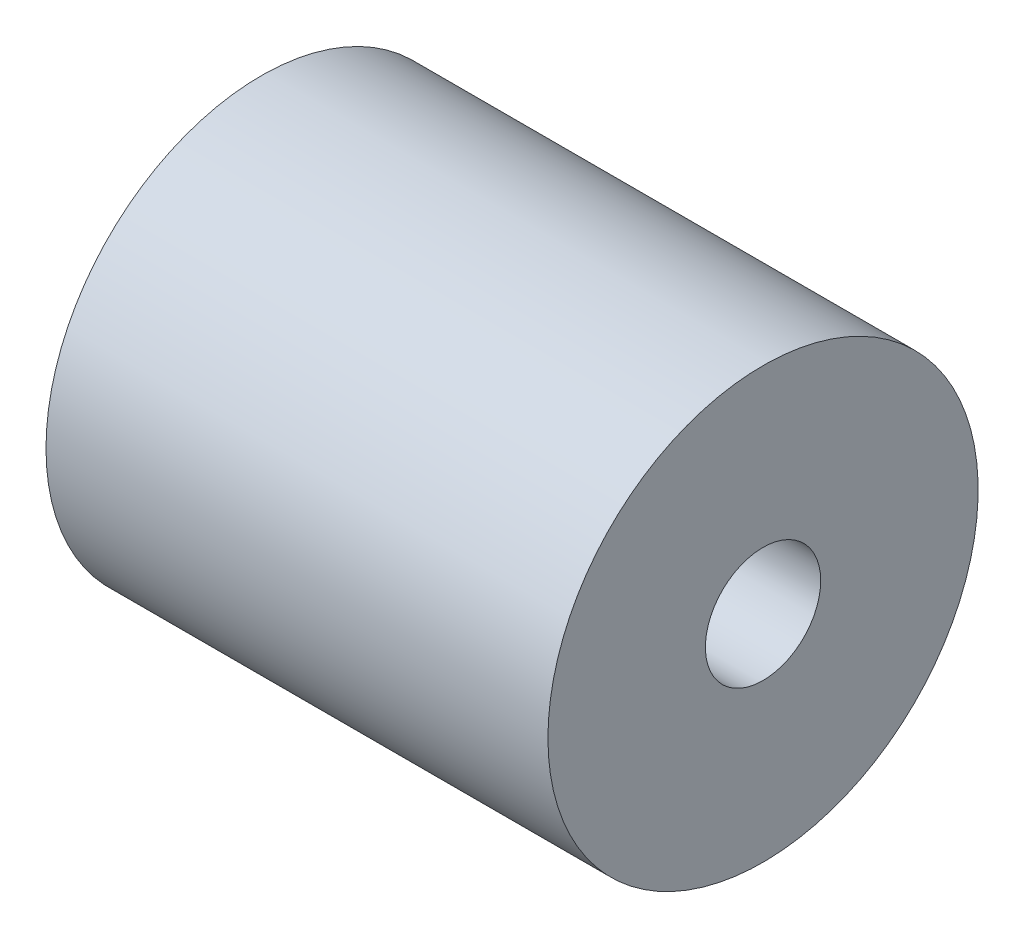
ISO-10303-21;
HEADER;
FILE_DESCRIPTION(('STEP AP214'),'2;1');
FILE_NAME('part.step','',(''),(''),'','','');
FILE_SCHEMA(('AUTOMOTIVE_DESIGN { 1 0 10303 214 1 1 1 1 }'));
ENDSEC;
DATA;
#1=APPLICATION_CONTEXT('core data for automotive mechanical design processes');
#2=APPLICATION_PROTOCOL_DEFINITION('international standard','automotive_design',2000,#1);
#3=PRODUCT_CONTEXT('',#1,'mechanical');
#4=PRODUCT('Part','Part','',(#3));
#5=PRODUCT_RELATED_PRODUCT_CATEGORY('part','',(#4));
#6=PRODUCT_DEFINITION_FORMATION('','',#4);
#7=PRODUCT_DEFINITION_CONTEXT('part definition',#1,'design');
#8=PRODUCT_DEFINITION('design','',#6,#7);
#9=PRODUCT_DEFINITION_SHAPE('','',#8);
#10=(LENGTH_UNIT() NAMED_UNIT(*) SI_UNIT(.MILLI.,.METRE.));
#11=(NAMED_UNIT(*) PLANE_ANGLE_UNIT() SI_UNIT($,.RADIAN.));
#12=(NAMED_UNIT(*) SI_UNIT($,.STERADIAN.) SOLID_ANGLE_UNIT());
#13=UNCERTAINTY_MEASURE_WITH_UNIT(LENGTH_MEASURE(1.E-05),#10,'distance_accuracy_value','');
#14=(GEOMETRIC_REPRESENTATION_CONTEXT(3) GLOBAL_UNCERTAINTY_ASSIGNED_CONTEXT((#13)) GLOBAL_UNIT_ASSIGNED_CONTEXT((#10,
#11,#12)) REPRESENTATION_CONTEXT('',''));
#15=CARTESIAN_POINT('',(0.,0.,0.));
#16=DIRECTION('',(0.,0.,1.));
#17=DIRECTION('',(1.,0.,0.));
#18=AXIS2_PLACEMENT_3D('',#15,#16,#17);
#19=CARTESIAN_POINT('',(9.52499999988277,0.,0.));
#20=DIRECTION('',(1.,0.,0.));
#21=DIRECTION('',(0.,0.,-1.));
#22=AXIS2_PLACEMENT_3D('',#19,#20,#21);
#23=CONICAL_SURFACE('',#22,2.55269999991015,1.02974425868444);
#24=CARTESIAN_POINT('',(7.99118309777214,0.,0.));
#25=VERTEX_POINT('',#24);
#26=VERTEX_LOOP('',#25);
#27=FACE_BOUND('',#26,.T.);
#28=CARTESIAN_POINT('',(9.525,0.,0.));
#29=DIRECTION('',(1.,0.,0.));
#30=DIRECTION('',(0.,0.,-1.));
#31=AXIS2_PLACEMENT_3D('',#28,#29,#30);
#32=CIRCLE('',#31,2.5527);
#33=CARTESIAN_POINT('',(9.525,0.,-2.5527));
#34=VERTEX_POINT('',#33);
#35=EDGE_CURVE('E41',#34,#34,#32,.T.);
#36=ORIENTED_EDGE('',*,*,#35,.T.);
#37=EDGE_LOOP('',(#36));
#38=FACE_BOUND('',#37,.T.);
#39=ADVANCED_FACE('F25',(#27,#38),#23,.F.);
#40=CARTESIAN_POINT('',(22.225,0.,0.));
#41=DIRECTION('',(1.,0.,0.));
#42=DIRECTION('',(0.,0.,-1.));
#43=AXIS2_PLACEMENT_3D('',#40,#41,#42);
#44=CYLINDRICAL_SURFACE('',#43,2.5527);
#45=CARTESIAN_POINT('',(22.225,0.,0.));
#46=DIRECTION('',(1.,0.,0.));
#47=DIRECTION('',(0.,0.,-1.));
#48=AXIS2_PLACEMENT_3D('',#45,#46,#47);
#49=CIRCLE('',#48,2.5527);
#50=CARTESIAN_POINT('',(22.225,0.,-2.5527));
#51=VERTEX_POINT('',#50);
#52=EDGE_CURVE('E28',#51,#51,#49,.F.);
#53=ORIENTED_EDGE('',*,*,#52,.F.);
#54=EDGE_LOOP('',(#53));
#55=FACE_BOUND('',#54,.T.);
#56=ORIENTED_EDGE('',*,*,#35,.F.);
#57=EDGE_LOOP('',(#56));
#58=FACE_BOUND('',#57,.T.);
#59=ADVANCED_FACE('F38',(#55,#58),#44,.F.);
#60=CARTESIAN_POINT('',(22.225,0.,0.));
#61=DIRECTION('',(1.,0.,0.));
#62=DIRECTION('',(0.,0.,-1.));
#63=AXIS2_PLACEMENT_3D('',#60,#61,#62);
#64=PLANE('',#63);
#65=CARTESIAN_POINT('',(22.225,0.,0.));
#66=DIRECTION('',(-1.,0.,0.));
#67=DIRECTION('',(0.,0.,1.));
#68=AXIS2_PLACEMENT_3D('',#65,#66,#67);
#69=CIRCLE('',#68,9.525);
#70=CARTESIAN_POINT('',(22.225,0.,9.525));
#71=VERTEX_POINT('',#70);
#72=EDGE_CURVE('E32',#71,#71,#69,.T.);
#73=ORIENTED_EDGE('',*,*,#72,.F.);
#74=EDGE_LOOP('',(#73));
#75=FACE_BOUND('',#74,.T.);
#76=ORIENTED_EDGE('',*,*,#52,.T.);
#77=EDGE_LOOP('',(#76));
#78=FACE_BOUND('',#77,.T.);
#79=ADVANCED_FACE('F50',(#75,#78),#64,.T.);
#80=CARTESIAN_POINT('',(0.,0.,0.));
#81=DIRECTION('',(1.,0.,0.));
#82=DIRECTION('',(0.,0.,-1.));
#83=AXIS2_PLACEMENT_3D('',#80,#81,#82);
#84=PLANE('',#83);
#85=CARTESIAN_POINT('',(0.,0.,0.));
#86=DIRECTION('',(-1.,0.,0.));
#87=DIRECTION('',(0.,0.,1.));
#88=AXIS2_PLACEMENT_3D('',#85,#86,#87);
#89=CIRCLE('',#88,9.525);
#90=CARTESIAN_POINT('',(0.,0.,9.525));
#91=VERTEX_POINT('',#90);
#92=EDGE_CURVE('E13',#91,#91,#89,.F.);
#93=ORIENTED_EDGE('',*,*,#92,.F.);
#94=EDGE_LOOP('',(#93));
#95=FACE_BOUND('',#94,.T.);
#96=ADVANCED_FACE('F53',(#95),#84,.F.);
#97=CARTESIAN_POINT('',(22.225,0.,0.));
#98=DIRECTION('',(-1.,0.,0.));
#99=DIRECTION('',(0.,0.,1.));
#100=AXIS2_PLACEMENT_3D('',#97,#98,#99);
#101=CYLINDRICAL_SURFACE('',#100,9.525);
#102=ORIENTED_EDGE('',*,*,#92,.T.);
#103=EDGE_LOOP('',(#102));
#104=FACE_BOUND('',#103,.T.);
#105=ORIENTED_EDGE('',*,*,#72,.T.);
#106=EDGE_LOOP('',(#105));
#107=FACE_BOUND('',#106,.T.);
#108=ADVANCED_FACE('F48',(#104,#107),#101,.T.);
#109=CLOSED_SHELL('',(#39,#59,#79,#96,#108));
#110=MANIFOLD_SOLID_BREP('B1',#109);
#111=ADVANCED_BREP_SHAPE_REPRESENTATION('',(#18,#110),#14);
#112=SHAPE_DEFINITION_REPRESENTATION(#9,#111);
ENDSEC;
END-ISO-10303-21;
